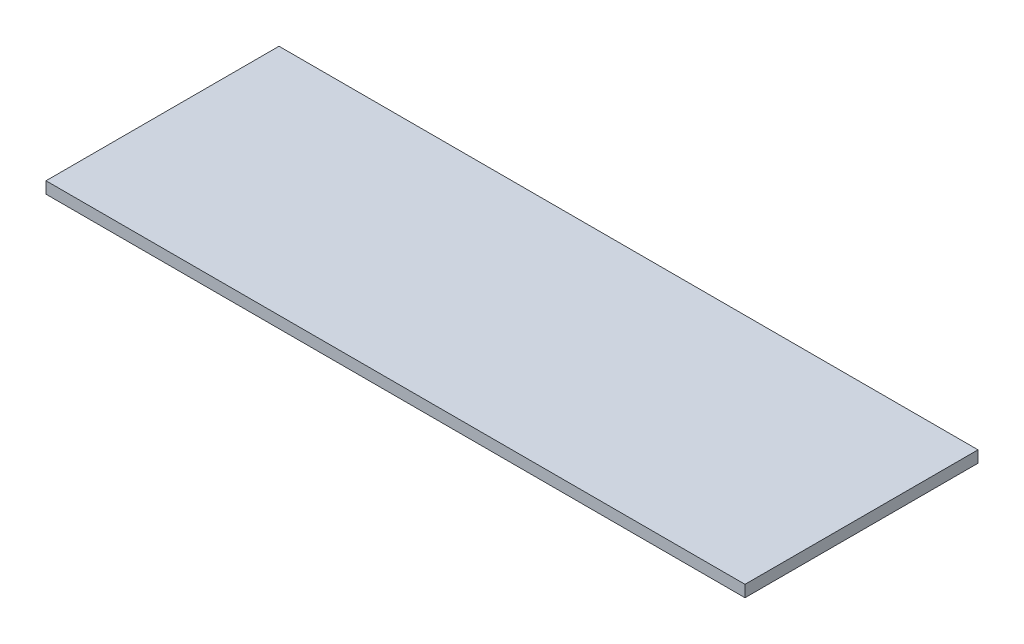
from build123d import *

# Parameters (mm, degrees)
ESQUISSE1_W        = 3000
ESQUISSE1_H        = 50
BOSS_EXTRU_1_DEPTH = 1000


with BuildPart() as part:
    # Esquisse1 → Boss.-Extru.1 (new body)
    with BuildSketch(Plane.XY):
        with Locations((1500, 25)):
            Rectangle(ESQUISSE1_W, ESQUISSE1_H)
    extrude(amount=BOSS_EXTRU_1_DEPTH)


solid = part.part
